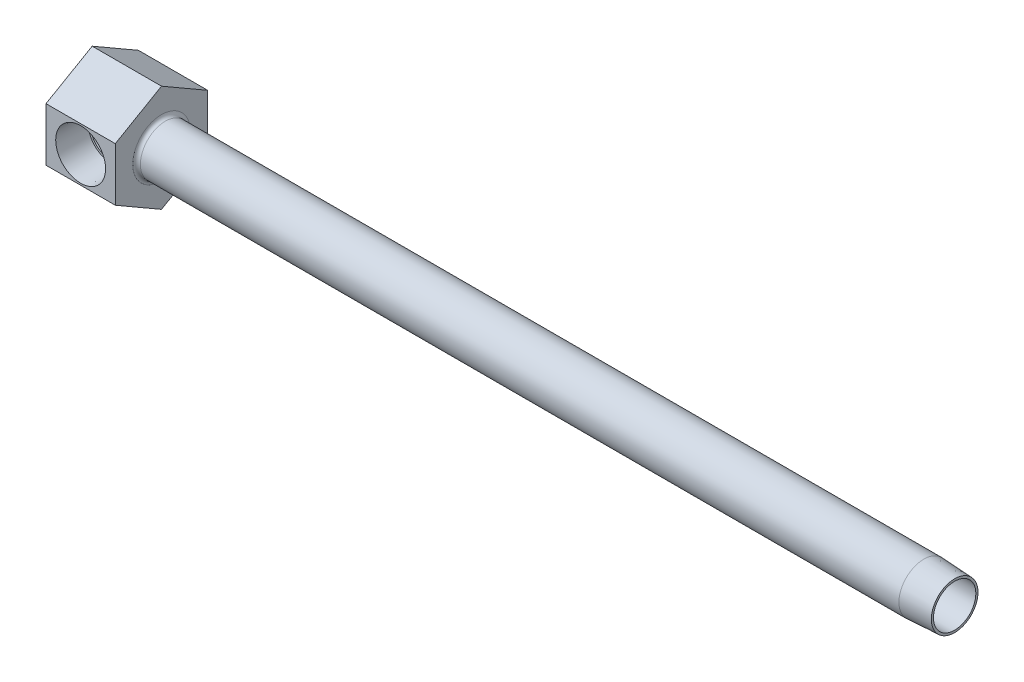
ISO-10303-21;
HEADER;
FILE_DESCRIPTION(('STEP AP214'),'2;1');
FILE_NAME('part.step','',(''),(''),'','','');
FILE_SCHEMA(('AUTOMOTIVE_DESIGN { 1 0 10303 214 1 1 1 1 }'));
ENDSEC;
DATA;
#1=APPLICATION_CONTEXT('core data for automotive mechanical design processes');
#2=APPLICATION_PROTOCOL_DEFINITION('international standard','automotive_design',2000,#1);
#3=PRODUCT_CONTEXT('',#1,'mechanical');
#4=PRODUCT('Part','Part','',(#3));
#5=PRODUCT_RELATED_PRODUCT_CATEGORY('part','',(#4));
#6=PRODUCT_DEFINITION_FORMATION('','',#4);
#7=PRODUCT_DEFINITION_CONTEXT('part definition',#1,'design');
#8=PRODUCT_DEFINITION('design','',#6,#7);
#9=PRODUCT_DEFINITION_SHAPE('','',#8);
#10=(LENGTH_UNIT() NAMED_UNIT(*) SI_UNIT(.MILLI.,.METRE.));
#11=(NAMED_UNIT(*) PLANE_ANGLE_UNIT() SI_UNIT($,.RADIAN.));
#12=(NAMED_UNIT(*) SI_UNIT($,.STERADIAN.) SOLID_ANGLE_UNIT());
#13=UNCERTAINTY_MEASURE_WITH_UNIT(LENGTH_MEASURE(1.E-05),#10,'distance_accuracy_value','');
#14=(GEOMETRIC_REPRESENTATION_CONTEXT(3) GLOBAL_UNCERTAINTY_ASSIGNED_CONTEXT((#13)) GLOBAL_UNIT_ASSIGNED_CONTEXT((#10,
#11,#12)) REPRESENTATION_CONTEXT('',''));
#15=CARTESIAN_POINT('',(0.,0.,0.));
#16=DIRECTION('',(0.,0.,1.));
#17=DIRECTION('',(1.,0.,0.));
#18=AXIS2_PLACEMENT_3D('',#15,#16,#17);
#19=CARTESIAN_POINT('',(7.14375,0.,19.05));
#20=DIRECTION('',(0.,0.,1.));
#21=DIRECTION('',(1.,0.,0.));
#22=AXIS2_PLACEMENT_3D('',#19,#20,#21);
#23=CONICAL_SURFACE('',#22,5.1435,0.0523598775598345);
#24=CARTESIAN_POINT('',(7.14375,0.,19.05));
#25=DIRECTION('',(0.,0.,-1.));
#26=DIRECTION('',(-1.,0.,0.));
#27=AXIS2_PLACEMENT_3D('',#24,#25,#26);
#28=CIRCLE('',#27,5.1435);
#29=CARTESIAN_POINT('',(2.00025,0.,19.05));
#30=VERTEX_POINT('',#29);
#31=EDGE_CURVE('E512',#30,#30,#28,.T.);
#32=ORIENTED_EDGE('',*,*,#31,.F.);
#33=EDGE_LOOP('',(#32));
#34=FACE_BOUND('',#33,.T.);
#35=CARTESIAN_POINT('',(7.14375,0.,12.7000000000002));
#36=DIRECTION('',(0.,0.,-1.));
#37=DIRECTION('',(-1.,0.,0.));
#38=AXIS2_PLACEMENT_3D('',#35,#36,#37);
#39=CIRCLE('',#38,4.81071060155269);
#40=CARTESIAN_POINT('',(10.9073758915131,-2.99634054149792,12.7000000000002));
#41=VERTEX_POINT('',#40);
#42=CARTESIAN_POINT('',(10.9073758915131,2.99634054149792,12.7000000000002));
#43=VERTEX_POINT('',#42);
#44=EDGE_CURVE('E528',#41,#43,#39,.T.);
#45=ORIENTED_EDGE('',*,*,#44,.T.);
#46=CARTESIAN_POINT('',(10.9071937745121,2.99655245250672,12.6998000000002));
#47=CARTESIAN_POINT('',(10.971635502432,2.92155827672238,12.7705639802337));
#48=CARTESIAN_POINT('',(11.0345784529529,2.84341410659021,12.8393139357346));
#49=CARTESIAN_POINT('',(11.1569073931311,2.68056902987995,12.9723675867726));
#50=CARTESIAN_POINT('',(11.2162880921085,2.59585877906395,13.0366646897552));
#51=CARTESIAN_POINT('',(11.3887731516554,2.33059710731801,13.2228141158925));
#52=CARTESIAN_POINT('',(11.4952955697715,2.13996459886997,13.3369144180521));
#53=CARTESIAN_POINT('',(11.6670238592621,1.76978922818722,13.520146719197));
#54=CARTESIAN_POINT('',(11.7362081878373,1.59429861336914,13.5936668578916));
#55=CARTESIAN_POINT('',(11.8243838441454,1.32069459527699,13.6871793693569));
#56=CARTESIAN_POINT('',(11.8511557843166,1.22786736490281,13.7155347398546));
#57=CARTESIAN_POINT('',(11.8990876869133,1.0391950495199,13.7662595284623));
#58=CARTESIAN_POINT('',(11.9202500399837,0.943351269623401,13.7886314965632));
#59=CARTESIAN_POINT('',(11.9566990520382,0.748466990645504,13.8271421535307));
#60=CARTESIAN_POINT('',(11.971935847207,0.649406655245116,13.8432279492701));
#61=CARTESIAN_POINT('',(11.9959472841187,0.449682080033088,13.8685692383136));
#62=CARTESIAN_POINT('',(12.0047249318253,0.349018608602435,13.8778279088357));
#63=CARTESIAN_POINT('',(12.0156291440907,0.146869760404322,13.8893288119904));
#64=CARTESIAN_POINT('',(12.0177517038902,0.0453839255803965,13.8915668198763));
#65=CARTESIAN_POINT('',(12.0152840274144,-0.157407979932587,13.8889645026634));
#66=CARTESIAN_POINT('',(12.0106943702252,-0.258714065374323,13.8841247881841));
#67=CARTESIAN_POINT('',(11.9957865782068,-0.449057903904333,13.8683984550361));
#68=CARTESIAN_POINT('',(11.9861593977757,-0.538211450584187,13.8582411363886));
#69=CARTESIAN_POINT('',(11.961864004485,-0.715062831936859,13.8325939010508));
#70=CARTESIAN_POINT('',(11.9471941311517,-0.802760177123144,13.8171022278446));
#71=CARTESIAN_POINT('',(11.8959888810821,-1.06271154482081,13.762990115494));
#72=CARTESIAN_POINT('',(11.8522396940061,-1.23204639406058,13.7167134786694));
#73=CARTESIAN_POINT('',(11.7458224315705,-1.56656708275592,13.6038703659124));
#74=CARTESIAN_POINT('',(11.6823922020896,-1.73122409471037,13.5364852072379));
#75=CARTESIAN_POINT('',(11.5406571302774,-2.04618319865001,13.3853583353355));
#76=CARTESIAN_POINT('',(11.4623317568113,-2.19646504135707,13.3015940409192));
#77=CARTESIAN_POINT('',(11.3067680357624,-2.45998630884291,13.1343941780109));
#78=CARTESIAN_POINT('',(11.2311482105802,-2.57539375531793,13.0528153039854));
#79=CARTESIAN_POINT('',(11.0735639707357,-2.79452635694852,12.8818550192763));
#80=CARTESIAN_POINT('',(10.9916301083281,-2.89830245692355,12.792510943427));
#81=CARTESIAN_POINT('',(10.9071937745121,-2.99655245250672,12.6998000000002));
#82=B_SPLINE_CURVE_WITH_KNOTS('',3,(#46,#47,#48,#49,#50,#51,#52,#53,#54,#55,#56,#57,#58,#59,#60,
#61,#62,#63,#64,#65,#66,#67,#68,#69,#70,#71,#72,#73,#74,#75,#76,#77,#78,#79,#80,#81),
.UNSPECIFIED.,.F.,.F.,(4,2,2,2,2,2,2,2,2,2,2,2,2,2,2,2,2,4),(0.,0.364634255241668,
0.72979730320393,1.46525067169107,2.06997219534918,2.37170467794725,2.67330836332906,
2.97739780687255,3.28134564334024,3.58547634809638,3.88958081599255,4.15999530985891,
4.43049893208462,4.97084503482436,5.53548493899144,6.10090884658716,6.58103480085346,
7.05896806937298),.UNSPECIFIED.);
#83=EDGE_CURVE('E123',#43,#41,#82,.T.);
#84=ORIENTED_EDGE('',*,*,#83,.T.);
#85=EDGE_LOOP('',(#45,#84));
#86=FACE_BOUND('',#85,.T.);
#87=ADVANCED_FACE('F15',(#34,#86),#23,.F.);
#88=CARTESIAN_POINT('',(11.9544606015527,0.,12.7000000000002));
#89=DIRECTION('',(0.,0.,1.));
#90=DIRECTION('',(1.,0.,0.));
#91=AXIS2_PLACEMENT_3D('',#88,#89,#90);
#92=PLANE('',#91);
#93=ORIENTED_EDGE('',*,*,#44,.F.);
#94=DIRECTION('',(1.,0.,0.));
#95=VECTOR('',#94,1.);
#96=CARTESIAN_POINT('',(66.1375087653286,-2.99634054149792,12.7000000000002));
#97=LINE('',#96,#95);
#98=CARTESIAN_POINT('',(10.3187500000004,-2.99634054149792,12.7000000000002));
#99=VERTEX_POINT('',#98);
#100=EDGE_CURVE('E120',#41,#99,#97,.F.);
#101=ORIENTED_EDGE('',*,*,#100,.T.);
#102=CARTESIAN_POINT('',(7.14375,0.,12.7000000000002));
#103=DIRECTION('',(0.,0.,-1.));
#104=DIRECTION('',(-1.,0.,0.));
#105=AXIS2_PLACEMENT_3D('',#102,#103,#104);
#106=CIRCLE('',#105,4.36562500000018);
#107=CARTESIAN_POINT('',(10.3187500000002,2.99634054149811,12.7000000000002));
#108=VERTEX_POINT('',#107);
#109=EDGE_CURVE('E119',#99,#108,#106,.T.);
#110=ORIENTED_EDGE('',*,*,#109,.T.);
#111=DIRECTION('',(1.,0.,0.));
#112=VECTOR('',#111,1.);
#113=CARTESIAN_POINT('',(66.1375087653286,2.99634054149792,12.7000000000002));
#114=LINE('',#113,#112);
#115=EDGE_CURVE('E126',#108,#43,#114,.T.);
#116=ORIENTED_EDGE('',*,*,#115,.T.);
#117=EDGE_LOOP('',(#93,#101,#110,#116));
#118=FACE_BOUND('',#117,.T.);
#119=ADVANCED_FACE('F156',(#118),#92,.T.);
#120=CARTESIAN_POINT('',(7.14375,0.,35.9059426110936));
#121=DIRECTION('',(0.,0.,-1.));
#122=DIRECTION('',(-1.,0.,0.));
#123=AXIS2_PLACEMENT_3D('',#120,#121,#122);
#124=CYLINDRICAL_SURFACE('',#123,4.36562500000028);
#125=ORIENTED_EDGE('',*,*,#109,.F.);
#126=CARTESIAN_POINT('',(7.14375,0.,9.525));
#127=DIRECTION('',(0.707106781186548,0.,-0.707106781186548));
#128=DIRECTION('',(-0.707106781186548,0.,-0.707106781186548));
#129=AXIS2_PLACEMENT_3D('',#126,#127,#128);
#130=ELLIPSE('',#129,6.17392608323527,4.36562500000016);
#131=CARTESIAN_POINT('',(7.14375,-4.3656250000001,9.525));
#132=VERTEX_POINT('',#131);
#133=EDGE_CURVE('E105',#99,#132,#130,.T.);
#134=ORIENTED_EDGE('',*,*,#133,.T.);
#135=CARTESIAN_POINT('',(7.14375,0.,9.525));
#136=DIRECTION('',(-0.707106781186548,0.,-0.707106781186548));
#137=DIRECTION('',(0.707106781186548,0.,-0.707106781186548));
#138=AXIS2_PLACEMENT_3D('',#135,#136,#137);
#139=ELLIPSE('',#138,6.17392608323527,4.36562500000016);
#140=CARTESIAN_POINT('',(8.98888023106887,-3.95653586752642,7.67986976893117));
#141=VERTEX_POINT('',#140);
#142=EDGE_CURVE('E100',#132,#141,#139,.F.);
#143=ORIENTED_EDGE('',*,*,#142,.T.);
#144=CARTESIAN_POINT('',(7.14375,0.,7.67986976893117));
#145=DIRECTION('',(0.,0.,-1.));
#146=DIRECTION('',(-1.,0.,0.));
#147=AXIS2_PLACEMENT_3D('',#144,#145,#146);
#148=CIRCLE('',#147,4.36562500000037);
#149=CARTESIAN_POINT('',(8.98888023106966,3.95653586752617,7.67986976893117));
#150=VERTEX_POINT('',#149);
#151=EDGE_CURVE('E113',#141,#150,#148,.T.);
#152=ORIENTED_EDGE('',*,*,#151,.T.);
#153=CARTESIAN_POINT('',(7.14375,4.3656250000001,9.525));
#154=VERTEX_POINT('',#153);
#155=EDGE_CURVE('E30',#150,#154,#139,.F.);
#156=ORIENTED_EDGE('',*,*,#155,.T.);
#157=EDGE_CURVE('E122',#154,#108,#130,.T.);
#158=ORIENTED_EDGE('',*,*,#157,.T.);
#159=EDGE_LOOP('',(#125,#134,#143,#152,#156,#158));
#160=FACE_BOUND('',#159,.T.);
#161=ADVANCED_FACE('F116',(#160),#124,.F.);
#162=CARTESIAN_POINT('',(7.14375,0.,7.67986976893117));
#163=DIRECTION('',(0.,0.,1.));
#164=DIRECTION('',(1.,0.,0.));
#165=AXIS2_PLACEMENT_3D('',#162,#163,#164);
#166=CONICAL_SURFACE('',#165,4.36562500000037,1.0471975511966);
#167=ORIENTED_EDGE('',*,*,#151,.F.);
#168=CARTESIAN_POINT('',(8.9894997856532,-3.95662913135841,7.68006976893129));
#169=CARTESIAN_POINT('',(8.91497560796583,-3.94541760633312,7.6560189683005));
#170=CARTESIAN_POINT('',(8.84020256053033,-3.93428272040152,7.6327193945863));
#171=CARTESIAN_POINT('',(8.69001846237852,-3.91242782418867,7.58793860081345));
#172=CARTESIAN_POINT('',(8.61460714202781,-3.90170800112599,7.56645819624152));
#173=CARTESIAN_POINT('',(8.38848524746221,-3.87074056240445,7.50556917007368));
#174=CARTESIAN_POINT('',(8.2367287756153,-3.8515020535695,7.46932807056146));
#175=CARTESIAN_POINT('',(8.00667896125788,-3.82676825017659,7.42384959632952));
#176=CARTESIAN_POINT('',(7.92948623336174,-3.81920348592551,7.41015805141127));
#177=CARTESIAN_POINT('',(7.77441965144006,-3.80585437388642,7.38622945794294));
#178=CARTESIAN_POINT('',(7.69654594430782,-3.80006965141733,7.37599168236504));
#179=CARTESIAN_POINT('',(7.53967894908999,-3.79060206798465,7.35933225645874));
#180=CARTESIAN_POINT('',(7.46068163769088,-3.78693482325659,7.35293894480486));
#181=CARTESIAN_POINT('',(7.30231301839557,-3.7819879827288,7.34434534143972));
#182=CARTESIAN_POINT('',(7.2229414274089,-3.78071064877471,7.34214902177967));
#183=CARTESIAN_POINT('',(7.14355,-3.78074215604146,7.34218750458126));
#184=B_SPLINE_CURVE_WITH_KNOTS('',3,(#168,#169,#170,#171,#172,#173,#174,#175,#176,#177,#178,
#179,#180,#181,#182,#183),.UNSPECIFIED.,.F.,.F.,(4,2,2,2,2,2,2,4),(0.,0.237303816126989,
0.474713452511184,0.945835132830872,1.18204117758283,1.41819746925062,1.65607385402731,
1.89417525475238),.UNSPECIFIED.);
#185=CARTESIAN_POINT('',(7.14375,-3.78074215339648,7.34218750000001));
#186=VERTEX_POINT('',#185);
#187=EDGE_CURVE('E109',#141,#186,#184,.T.);
#188=ORIENTED_EDGE('',*,*,#187,.T.);
#189=DIRECTION('',(0.,0.866025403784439,-0.5));
#190=VECTOR('',#189,1.);
#191=CARTESIAN_POINT('',(7.14375,0.,5.159375));
#192=LINE('',#191,#190);
#193=CARTESIAN_POINT('',(7.14375,0.,5.159375));
#194=VERTEX_POINT('',#193);
#195=EDGE_CURVE('E200',#186,#194,#192,.T.);
#196=ORIENTED_EDGE('',*,*,#195,.T.);
#197=DIRECTION('',(0.,0.866025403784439,0.5));
#198=VECTOR('',#197,1.);
#199=CARTESIAN_POINT('',(7.14375,0.,5.159375));
#200=LINE('',#199,#198);
#201=CARTESIAN_POINT('',(7.14375,3.78074215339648,7.34218750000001));
#202=VERTEX_POINT('',#201);
#203=EDGE_CURVE('E486',#194,#202,#200,.T.);
#204=ORIENTED_EDGE('',*,*,#203,.T.);
#205=CARTESIAN_POINT('',(7.14355,3.78074215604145,7.34218750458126));
#206=CARTESIAN_POINT('',(7.20515303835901,3.78073202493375,7.34217451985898));
#207=CARTESIAN_POINT('',(7.26674694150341,3.78149280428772,7.34348695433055));
#208=CARTESIAN_POINT('',(7.38976236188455,3.78448017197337,7.34867189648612));
#209=CARTESIAN_POINT('',(7.45118394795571,3.78670605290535,7.3525431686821));
#210=CARTESIAN_POINT('',(7.63466542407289,3.79545033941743,7.36782927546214));
#211=CARTESIAN_POINT('',(7.75632841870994,3.80403629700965,7.38291749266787));
#212=CARTESIAN_POINT('',(8.11659337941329,3.83592256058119,7.44024735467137));
#213=CARTESIAN_POINT('',(8.35266311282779,3.8653919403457,7.49460284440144));
#214=CARTESIAN_POINT('',(8.65303625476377,3.90716169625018,7.57737916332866));
#215=CARTESIAN_POINT('',(8.72054620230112,3.91683509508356,7.59689306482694));
#216=CARTESIAN_POINT('',(8.855265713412,3.93652410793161,7.63741882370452));
#217=CARTESIAN_POINT('',(8.92247399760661,3.94654056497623,7.65843453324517));
#218=CARTESIAN_POINT('',(8.9894997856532,3.9566291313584,7.68006976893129));
#219=B_SPLINE_CURVE_WITH_KNOTS('',3,(#205,#206,#207,#208,#209,#210,#211,#212,#213,#214,#215,
#216,#217,#218),.UNSPECIFIED.,.F.,.F.,(4,2,2,2,2,2,4),(0.,0.184774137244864,0.369459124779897,
0.73767480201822,1.46761028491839,1.68043381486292,1.89382432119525),.UNSPECIFIED.);
#220=EDGE_CURVE('E187',#202,#150,#219,.T.);
#221=ORIENTED_EDGE('',*,*,#220,.T.);
#222=EDGE_LOOP('',(#167,#188,#196,#204,#221));
#223=FACE_BOUND('',#222,.T.);
#224=ADVANCED_FACE('F201',(#223),#166,.F.);
#225=CARTESIAN_POINT('',(14.2875,5.4992613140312,19.05));
#226=DIRECTION('',(0.,0.,-1.));
#227=DIRECTION('',(-1.,0.,0.));
#228=AXIS2_PLACEMENT_3D('',#225,#226,#227);
#229=PLANE('',#228);
#230=DIRECTION('',(0.,-1.,0.));
#231=VECTOR('',#230,1.);
#232=CARTESIAN_POINT('',(0.,5.4992613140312,19.05));
#233=LINE('',#232,#231);
#234=CARTESIAN_POINT('',(0.,5.4992613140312,19.05));
#235=VERTEX_POINT('',#234);
#236=CARTESIAN_POINT('',(0.,-5.49926131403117,19.05));
#237=VERTEX_POINT('',#236);
#238=EDGE_CURVE('E515',#235,#237,#233,.T.);
#239=ORIENTED_EDGE('',*,*,#238,.T.);
#240=DIRECTION('',(-1.,0.,0.));
#241=VECTOR('',#240,1.);
#242=CARTESIAN_POINT('',(14.2875,-5.49926131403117,19.05));
#243=LINE('',#242,#241);
#244=CARTESIAN_POINT('',(14.2875,-5.49926131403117,19.05));
#245=VERTEX_POINT('',#244);
#246=EDGE_CURVE('E496',#245,#237,#243,.T.);
#247=ORIENTED_EDGE('',*,*,#246,.F.);
#248=DIRECTION('',(0.,-1.,0.));
#249=VECTOR('',#248,1.);
#250=CARTESIAN_POINT('',(14.2875,5.4992613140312,19.05));
#251=LINE('',#250,#249);
#252=CARTESIAN_POINT('',(14.2875,5.4992613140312,19.05));
#253=VERTEX_POINT('',#252);
#254=EDGE_CURVE('E502',#253,#245,#251,.T.);
#255=ORIENTED_EDGE('',*,*,#254,.F.);
#256=DIRECTION('',(-1.,0.,0.));
#257=VECTOR('',#256,1.);
#258=CARTESIAN_POINT('',(14.2875,5.4992613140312,19.05));
#259=LINE('',#258,#257);
#260=EDGE_CURVE('E493',#253,#235,#259,.T.);
#261=ORIENTED_EDGE('',*,*,#260,.T.);
#262=EDGE_LOOP('',(#239,#247,#255,#261));
#263=FACE_BOUND('',#262,.T.);
#264=ORIENTED_EDGE('',*,*,#31,.T.);
#265=EDGE_LOOP('',(#264));
#266=FACE_BOUND('',#265,.T.);
#267=ADVANCED_FACE('F204',(#263,#266),#229,.F.);
#268=CARTESIAN_POINT('',(14.2875,-5.49926131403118,0.));
#269=DIRECTION('',(1.,0.,0.));
#270=DIRECTION('',(0.,1.,0.));
#271=AXIS2_PLACEMENT_3D('',#268,#269,#270);
#272=PLANE('',#271);
#273=CARTESIAN_POINT('',(14.2875,0.,9.525));
#274=DIRECTION('',(1.,0.,0.));
#275=DIRECTION('',(0.,1.,0.));
#276=AXIS2_PLACEMENT_3D('',#273,#274,#275);
#277=CIRCLE('',#276,5.9309);
#278=CARTESIAN_POINT('',(14.2875,5.9309,9.525));
#279=VERTEX_POINT('',#278);
#280=EDGE_CURVE('E199',#279,#279,#277,.F.);
#281=ORIENTED_EDGE('',*,*,#280,.T.);
#282=EDGE_LOOP('',(#281));
#283=FACE_BOUND('',#282,.T.);
#284=DIRECTION('',(0.,0.5,-0.866025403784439));
#285=VECTOR('',#284,1.);
#286=CARTESIAN_POINT('',(14.2875,-10.9985226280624,9.525));
#287=LINE('',#286,#285);
#288=CARTESIAN_POINT('',(14.2875,-10.9985226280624,9.525));
#289=VERTEX_POINT('',#288);
#290=CARTESIAN_POINT('',(14.2875,-5.49926131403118,0.));
#291=VERTEX_POINT('',#290);
#292=EDGE_CURVE('E473',#289,#291,#287,.T.);
#293=ORIENTED_EDGE('',*,*,#292,.T.);
#294=DIRECTION('',(0.,1.,0.));
#295=VECTOR('',#294,1.);
#296=CARTESIAN_POINT('',(14.2875,-5.49926131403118,0.));
#297=LINE('',#296,#295);
#298=CARTESIAN_POINT('',(14.2875,5.49926131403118,0.));
#299=VERTEX_POINT('',#298);
#300=EDGE_CURVE('E475',#291,#299,#297,.T.);
#301=ORIENTED_EDGE('',*,*,#300,.T.);
#302=DIRECTION('',(0.,0.5,0.866025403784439));
#303=VECTOR('',#302,1.);
#304=CARTESIAN_POINT('',(14.2875,5.49926131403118,0.));
#305=LINE('',#304,#303);
#306=CARTESIAN_POINT('',(14.2875,10.9985226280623,9.525));
#307=VERTEX_POINT('',#306);
#308=EDGE_CURVE('E506',#299,#307,#305,.T.);
#309=ORIENTED_EDGE('',*,*,#308,.T.);
#310=DIRECTION('',(0.,-0.5,0.86602540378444));
#311=VECTOR('',#310,1.);
#312=CARTESIAN_POINT('',(14.2875,10.9985226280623,9.525));
#313=LINE('',#312,#311);
#314=EDGE_CURVE('E504',#307,#253,#313,.T.);
#315=ORIENTED_EDGE('',*,*,#314,.T.);
#316=ORIENTED_EDGE('',*,*,#254,.T.);
#317=DIRECTION('',(0.,-0.5,-0.866025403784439));
#318=VECTOR('',#317,1.);
#319=CARTESIAN_POINT('',(14.2875,-5.49926131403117,19.05));
#320=LINE('',#319,#318);
#321=EDGE_CURVE('E38',#245,#289,#320,.T.);
#322=ORIENTED_EDGE('',*,*,#321,.T.);
#323=EDGE_LOOP('',(#293,#301,#309,#315,#316,#322));
#324=FACE_BOUND('',#323,.T.);
#325=ADVANCED_FACE('F230',(#283,#324),#272,.T.);
#326=CARTESIAN_POINT('',(14.2875,-10.9985226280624,9.525));
#327=DIRECTION('',(0.,0.866025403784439,0.5));
#328=DIRECTION('',(0.,-0.5,0.866025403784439));
#329=AXIS2_PLACEMENT_3D('',#326,#327,#328);
#330=PLANE('',#329);
#331=DIRECTION('',(0.,0.5,-0.866025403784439));
#332=VECTOR('',#331,1.);
#333=CARTESIAN_POINT('',(0.,-10.9985226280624,9.525));
#334=LINE('',#333,#332);
#335=CARTESIAN_POINT('',(0.,-10.9985226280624,9.525));
#336=VERTEX_POINT('',#335);
#337=CARTESIAN_POINT('',(0.,-5.49926131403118,0.));
#338=VERTEX_POINT('',#337);
#339=EDGE_CURVE('E484',#336,#338,#334,.T.);
#340=ORIENTED_EDGE('',*,*,#339,.T.);
#341=DIRECTION('',(-1.,0.,0.));
#342=VECTOR('',#341,1.);
#343=CARTESIAN_POINT('',(14.2875,-5.49926131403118,0.));
#344=LINE('',#343,#342);
#345=EDGE_CURVE('E482',#291,#338,#344,.T.);
#346=ORIENTED_EDGE('',*,*,#345,.F.);
#347=ORIENTED_EDGE('',*,*,#292,.F.);
#348=DIRECTION('',(-1.,0.,0.));
#349=VECTOR('',#348,1.);
#350=CARTESIAN_POINT('',(14.2875,-10.9985226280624,9.525));
#351=LINE('',#350,#349);
#352=EDGE_CURVE('E499',#289,#336,#351,.T.);
#353=ORIENTED_EDGE('',*,*,#352,.T.);
#354=EDGE_LOOP('',(#340,#346,#347,#353));
#355=FACE_BOUND('',#354,.T.);
#356=ADVANCED_FACE('F239',(#355),#330,.F.);
#357=CARTESIAN_POINT('',(14.2875,-5.49926131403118,0.));
#358=DIRECTION('',(0.,0.,1.));
#359=DIRECTION('',(0.,-1.,0.));
#360=AXIS2_PLACEMENT_3D('',#357,#358,#359);
#361=PLANE('',#360);
#362=DIRECTION('',(0.,1.,0.));
#363=VECTOR('',#362,1.);
#364=CARTESIAN_POINT('',(0.,-5.49926131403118,0.));
#365=LINE('',#364,#363);
#366=CARTESIAN_POINT('',(0.,5.49926131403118,0.));
#367=VERTEX_POINT('',#366);
#368=EDGE_CURVE('E511',#338,#367,#365,.T.);
#369=ORIENTED_EDGE('',*,*,#368,.T.);
#370=DIRECTION('',(-1.,0.,0.));
#371=VECTOR('',#370,1.);
#372=CARTESIAN_POINT('',(14.2875,5.49926131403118,0.));
#373=LINE('',#372,#371);
#374=EDGE_CURVE('E485',#299,#367,#373,.T.);
#375=ORIENTED_EDGE('',*,*,#374,.F.);
#376=ORIENTED_EDGE('',*,*,#300,.F.);
#377=ORIENTED_EDGE('',*,*,#345,.T.);
#378=EDGE_LOOP('',(#369,#375,#376,#377));
#379=FACE_BOUND('',#378,.T.);
#380=ADVANCED_FACE('F247',(#379),#361,.F.);
#381=CARTESIAN_POINT('',(14.2875,5.49926131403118,0.));
#382=DIRECTION('',(0.,-0.866025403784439,0.5));
#383=DIRECTION('',(0.,-0.5,-0.866025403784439));
#384=AXIS2_PLACEMENT_3D('',#381,#382,#383);
#385=PLANE('',#384);
#386=DIRECTION('',(0.,0.5,0.866025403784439));
#387=VECTOR('',#386,1.);
#388=CARTESIAN_POINT('',(0.,5.49926131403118,0.));
#389=LINE('',#388,#387);
#390=CARTESIAN_POINT('',(0.,10.9985226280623,9.525));
#391=VERTEX_POINT('',#390);
#392=EDGE_CURVE('E521',#367,#391,#389,.T.);
#393=ORIENTED_EDGE('',*,*,#392,.T.);
#394=DIRECTION('',(-1.,0.,0.));
#395=VECTOR('',#394,1.);
#396=CARTESIAN_POINT('',(14.2875,10.9985226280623,9.525));
#397=LINE('',#396,#395);
#398=EDGE_CURVE('E488',#307,#391,#397,.T.);
#399=ORIENTED_EDGE('',*,*,#398,.F.);
#400=ORIENTED_EDGE('',*,*,#308,.F.);
#401=ORIENTED_EDGE('',*,*,#374,.T.);
#402=EDGE_LOOP('',(#393,#399,#400,#401));
#403=FACE_BOUND('',#402,.T.);
#404=ADVANCED_FACE('F255',(#403),#385,.F.);
#405=CARTESIAN_POINT('',(14.2875,10.9985226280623,9.525));
#406=DIRECTION('',(0.,-0.86602540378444,-0.5));
#407=DIRECTION('',(0.,0.5,-0.86602540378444));
#408=AXIS2_PLACEMENT_3D('',#405,#406,#407);
#409=PLANE('',#408);
#410=DIRECTION('',(0.,-0.5,0.86602540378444));
#411=VECTOR('',#410,1.);
#412=CARTESIAN_POINT('',(0.,10.9985226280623,9.525));
#413=LINE('',#412,#411);
#414=EDGE_CURVE('E518',#391,#235,#413,.T.);
#415=ORIENTED_EDGE('',*,*,#414,.T.);
#416=ORIENTED_EDGE('',*,*,#260,.F.);
#417=ORIENTED_EDGE('',*,*,#314,.F.);
#418=ORIENTED_EDGE('',*,*,#398,.T.);
#419=EDGE_LOOP('',(#415,#416,#417,#418));
#420=FACE_BOUND('',#419,.T.);
#421=ADVANCED_FACE('F264',(#420),#409,.F.);
#422=CARTESIAN_POINT('',(14.2875,-5.49926131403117,19.05));
#423=DIRECTION('',(0.,0.866025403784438,-0.5));
#424=DIRECTION('',(0.,0.5,0.866025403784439));
#425=AXIS2_PLACEMENT_3D('',#422,#423,#424);
#426=PLANE('',#425);
#427=DIRECTION('',(0.,-0.5,-0.866025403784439));
#428=VECTOR('',#427,1.);
#429=CARTESIAN_POINT('',(0.,-5.49926131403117,19.05));
#430=LINE('',#429,#428);
#431=EDGE_CURVE('E478',#237,#336,#430,.T.);
#432=ORIENTED_EDGE('',*,*,#431,.T.);
#433=ORIENTED_EDGE('',*,*,#352,.F.);
#434=ORIENTED_EDGE('',*,*,#321,.F.);
#435=ORIENTED_EDGE('',*,*,#246,.T.);
#436=EDGE_LOOP('',(#432,#433,#434,#435));
#437=FACE_BOUND('',#436,.T.);
#438=ADVANCED_FACE('F273',(#437),#426,.F.);
#439=CARTESIAN_POINT('',(0.,-5.49926131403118,0.));
#440=DIRECTION('',(1.,0.,0.));
#441=DIRECTION('',(0.,1.,0.));
#442=AXIS2_PLACEMENT_3D('',#439,#440,#441);
#443=PLANE('',#442);
#444=ORIENTED_EDGE('',*,*,#339,.F.);
#445=ORIENTED_EDGE('',*,*,#431,.F.);
#446=ORIENTED_EDGE('',*,*,#238,.F.);
#447=ORIENTED_EDGE('',*,*,#414,.F.);
#448=ORIENTED_EDGE('',*,*,#392,.F.);
#449=ORIENTED_EDGE('',*,*,#368,.F.);
#450=EDGE_LOOP('',(#444,#445,#446,#447,#448,#449));
#451=FACE_BOUND('',#450,.T.);
#452=ADVANCED_FACE('F170',(#451),#443,.F.);
#453=CARTESIAN_POINT('',(68.0114010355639,0.,9.525));
#454=DIRECTION('',(-1.,0.,0.));
#455=DIRECTION('',(0.,0.,1.));
#456=AXIS2_PLACEMENT_3D('',#453,#454,#455);
#457=CYLINDRICAL_SURFACE('',#456,5.1435);
#458=CARTESIAN_POINT('',(171.45,0.,9.525));
#459=DIRECTION('',(-1.,0.,0.));
#460=DIRECTION('',(0.,0.,1.));
#461=AXIS2_PLACEMENT_3D('',#458,#459,#460);
#462=CIRCLE('',#461,5.1435);
#463=CARTESIAN_POINT('',(171.45,0.,14.6685));
#464=VERTEX_POINT('',#463);
#465=EDGE_CURVE('E10',#464,#464,#462,.F.);
#466=ORIENTED_EDGE('',*,*,#465,.F.);
#467=EDGE_LOOP('',(#466));
#468=FACE_BOUND('',#467,.T.);
#469=CARTESIAN_POINT('',(15.0749,0.,9.525));
#470=DIRECTION('',(1.,0.,0.));
#471=DIRECTION('',(0.,1.,0.));
#472=AXIS2_PLACEMENT_3D('',#469,#470,#471);
#473=CIRCLE('',#472,5.1435);
#474=CARTESIAN_POINT('',(15.0749,5.1435,9.525));
#475=VERTEX_POINT('',#474);
#476=EDGE_CURVE('E23',#475,#475,#473,.T.);
#477=ORIENTED_EDGE('',*,*,#476,.T.);
#478=EDGE_LOOP('',(#477));
#479=FACE_BOUND('',#478,.T.);
#480=ADVANCED_FACE('F17',(#468,#479),#457,.T.);
#481=CARTESIAN_POINT('',(7.14375,0.,9.525));
#482=DIRECTION('',(1.,0.,0.));
#483=DIRECTION('',(0.,0.,-1.));
#484=AXIS2_PLACEMENT_3D('',#481,#482,#483);
#485=PLANE('',#484);
#486=CARTESIAN_POINT('',(7.14375,0.,9.525));
#487=DIRECTION('',(1.,0.,0.));
#488=DIRECTION('',(0.,0.,-1.));
#489=AXIS2_PLACEMENT_3D('',#486,#487,#488);
#490=CIRCLE('',#489,4.365625);
#491=EDGE_CURVE('E130',#194,#202,#490,.T.);
#492=ORIENTED_EDGE('',*,*,#491,.T.);
#493=ORIENTED_EDGE('',*,*,#203,.F.);
#494=EDGE_LOOP('',(#492,#493));
#495=FACE_BOUND('',#494,.T.);
#496=ADVANCED_FACE('F297',(#495),#485,.T.);
#497=EDGE_CURVE('E128',#186,#194,#490,.T.);
#498=ORIENTED_EDGE('',*,*,#497,.T.);
#499=ORIENTED_EDGE('',*,*,#195,.F.);
#500=EDGE_LOOP('',(#498,#499));
#501=FACE_BOUND('',#500,.T.);
#502=ADVANCED_FACE('F182',(#501),#485,.T.);
#503=CARTESIAN_POINT('',(66.1375087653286,0.,9.525));
#504=DIRECTION('',(1.,0.,0.));
#505=DIRECTION('',(0.,0.,-1.));
#506=AXIS2_PLACEMENT_3D('',#503,#504,#505);
#507=CYLINDRICAL_SURFACE('',#506,4.365625);
#508=ORIENTED_EDGE('',*,*,#142,.F.);
#509=ORIENTED_EDGE('',*,*,#133,.F.);
#510=ORIENTED_EDGE('',*,*,#100,.F.);
#511=ORIENTED_EDGE('',*,*,#83,.F.);
#512=ORIENTED_EDGE('',*,*,#115,.F.);
#513=ORIENTED_EDGE('',*,*,#157,.F.);
#514=ORIENTED_EDGE('',*,*,#155,.F.);
#515=ORIENTED_EDGE('',*,*,#220,.F.);
#516=ORIENTED_EDGE('',*,*,#491,.F.);
#517=ORIENTED_EDGE('',*,*,#497,.F.);
#518=ORIENTED_EDGE('',*,*,#187,.F.);
#519=EDGE_LOOP('',(#508,#509,#510,#511,#512,#513,#514,#515,#516,#517,#518));
#520=FACE_BOUND('',#519,.T.);
#521=CARTESIAN_POINT('',(177.8,0.,9.525));
#522=DIRECTION('',(1.,0.,0.));
#523=DIRECTION('',(0.,0.,-1.));
#524=AXIS2_PLACEMENT_3D('',#521,#522,#523);
#525=CIRCLE('',#524,4.365625);
#526=CARTESIAN_POINT('',(177.8,0.,5.159375));
#527=VERTEX_POINT('',#526);
#528=EDGE_CURVE('E134',#527,#527,#525,.T.);
#529=ORIENTED_EDGE('',*,*,#528,.T.);
#530=EDGE_LOOP('',(#529));
#531=FACE_BOUND('',#530,.T.);
#532=ADVANCED_FACE('F102',(#520,#531),#507,.F.);
#533=CARTESIAN_POINT('',(15.0749,0.,9.525));
#534=DIRECTION('',(1.,0.,0.));
#535=DIRECTION('',(0.,1.,0.));
#536=AXIS2_PLACEMENT_3D('',#533,#534,#535);
#537=TOROIDAL_SURFACE('',#536,5.9309,0.7874);
#538=ORIENTED_EDGE('',*,*,#476,.F.);
#539=EDGE_LOOP('',(#538));
#540=FACE_BOUND('',#539,.T.);
#541=ORIENTED_EDGE('',*,*,#280,.F.);
#542=EDGE_LOOP('',(#541));
#543=FACE_BOUND('',#542,.T.);
#544=ADVANCED_FACE('F153',(#540,#543),#537,.F.);
#545=CARTESIAN_POINT('',(177.8,0.,5.159375));
#546=DIRECTION('',(1.,0.,0.));
#547=DIRECTION('',(0.,0.,-1.));
#548=AXIS2_PLACEMENT_3D('',#545,#546,#547);
#549=PLANE('',#548);
#550=CARTESIAN_POINT('',(177.8,0.,9.525));
#551=DIRECTION('',(1.,0.,0.));
#552=DIRECTION('',(0.,0.,-1.));
#553=AXIS2_PLACEMENT_3D('',#550,#551,#552);
#554=CIRCLE('',#553,4.81071060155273);
#555=CARTESIAN_POINT('',(177.8,0.,4.71428939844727));
#556=VERTEX_POINT('',#555);
#557=EDGE_CURVE('E137',#556,#556,#554,.T.);
#558=ORIENTED_EDGE('',*,*,#557,.T.);
#559=EDGE_LOOP('',(#558));
#560=FACE_BOUND('',#559,.T.);
#561=ORIENTED_EDGE('',*,*,#528,.F.);
#562=EDGE_LOOP('',(#561));
#563=FACE_BOUND('',#562,.T.);
#564=ADVANCED_FACE('F141',(#560,#563),#549,.T.);
#565=CARTESIAN_POINT('',(177.8,0.,9.525));
#566=DIRECTION('',(-1.,0.,0.));
#567=DIRECTION('',(0.,0.,1.));
#568=AXIS2_PLACEMENT_3D('',#565,#566,#567);
#569=CONICAL_SURFACE('',#568,4.81071060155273,0.052359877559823);
#570=ORIENTED_EDGE('',*,*,#465,.T.);
#571=EDGE_LOOP('',(#570));
#572=FACE_BOUND('',#571,.T.);
#573=ORIENTED_EDGE('',*,*,#557,.F.);
#574=EDGE_LOOP('',(#573));
#575=FACE_BOUND('',#574,.T.);
#576=ADVANCED_FACE('F144',(#572,#575),#569,.T.);
#577=CLOSED_SHELL('',(#87,#119,#161,#224,#267,#325,#356,#380,#404,#421,#438,#452,#480,#496,#502,
#532,#544,#564,#576));
#578=MANIFOLD_SOLID_BREP('B1',#577);
#579=ADVANCED_BREP_SHAPE_REPRESENTATION('',(#18,#578),#14);
#580=SHAPE_DEFINITION_REPRESENTATION(#9,#579);
ENDSEC;
END-ISO-10303-21;
